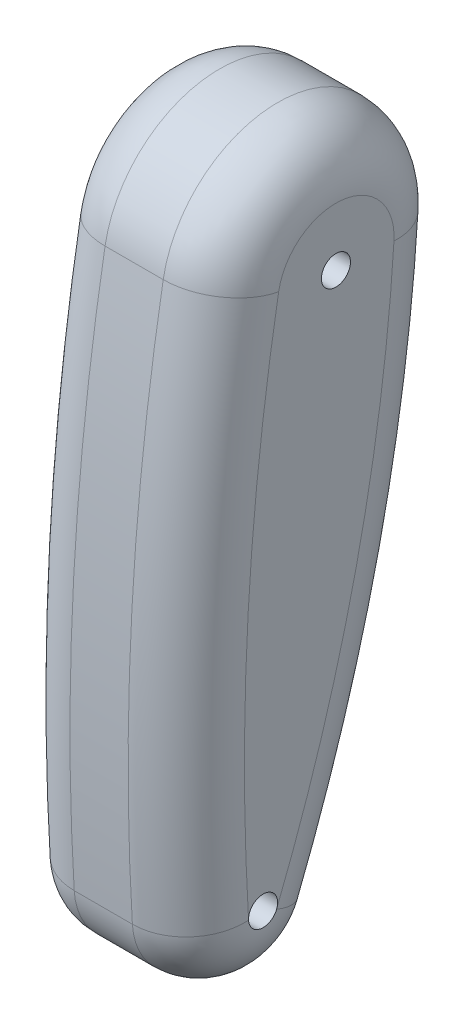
from build123d import *

# Parameters (mm, degrees)
BASE_EXTRUDE_DEPTH = 76.2
FILLET1_R          = 50.8
SKETCH7_R          = 12.7
CUT_EXTRUDE1_DEPTH = 554.919452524


with BuildPart() as part:
    # Sketch6 → Base-Extrude (new, symmetric)
    with BuildSketch(Plane(origin=(0, 0, 0), x_dir=(0, 0, -1), z_dir=(1, 0, 0))):
        with BuildLine():
            ThreePointArc((101.396599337, -6.425701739), (12.020811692, 100.886372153), (-100.067642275, 17.579162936))
            ThreePointArc((-100.067642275, 17.579162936), (-127.441368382, -218.711001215), (-127.014301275, -456.581092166))
            ThreePointArc((-127.014301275, -456.581092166), (-73.758039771, -515.437654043), (-4.676791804, -476.346664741))
            ThreePointArc((-4.676791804, -476.346664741), (67.045380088, -245.603981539), (101.396599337, -6.425701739))
        make_face()
    extrude(amount=BASE_EXTRUDE_DEPTH, both=True)

    # Fillet1
    fillet1_edges = [part.edges().sort_by_distance(p)[0] for p in [
        (76.2, -245.603981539, -67.045380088),
        (76.2, 100.886372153, -12.020811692),
        (76.2, -218.711001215, 127.441368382),
        (-76.2, 100.886372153, -12.020811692),
        (-76.2, -245.603981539, -67.045380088),
        (-76.2, -515.437654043, 73.758039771),
        (-76.2, -218.711001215, 127.441368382),
        (76.2, -515.437654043, 73.758039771),
    ]]
    fillet(fillet1_edges, radius=FILLET1_R)

    # Sketch7 → Cut-Extrude1 (cut, through all)
    with BuildSketch(Plane.ZY.offset(76.2)):
        Circle(SKETCH7_R)
        with Locations(Location((63.629941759, -452.750561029, 0), (0, 0, 356.541628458))):
            Circle(SKETCH7_R)
    extrude(amount=-CUT_EXTRUDE1_DEPTH, mode=Mode.SUBTRACT)


solid = part.part
